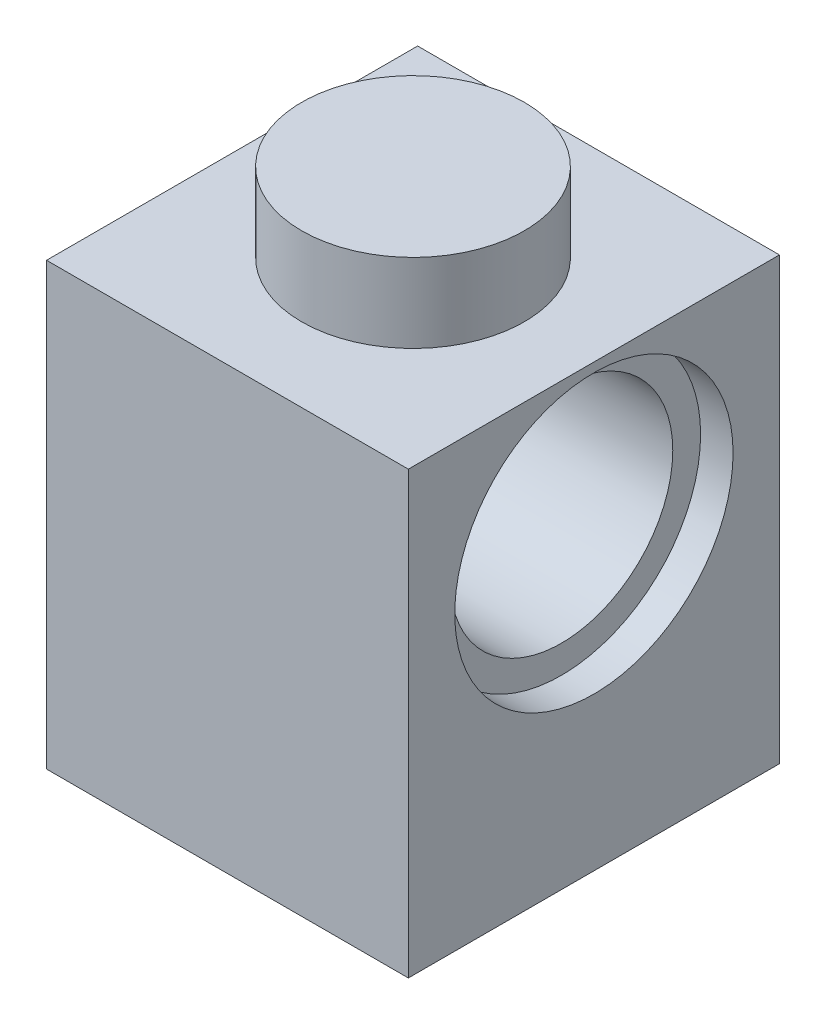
ISO-10303-21;
HEADER;
FILE_DESCRIPTION(('STEP AP214'),'2;1');
FILE_NAME('part.step','',(''),(''),'','','');
FILE_SCHEMA(('AUTOMOTIVE_DESIGN { 1 0 10303 214 1 1 1 1 }'));
ENDSEC;
DATA;
#1=APPLICATION_CONTEXT('core data for automotive mechanical design processes');
#2=APPLICATION_PROTOCOL_DEFINITION('international standard','automotive_design',2000,#1);
#3=PRODUCT_CONTEXT('',#1,'mechanical');
#4=PRODUCT('Part','Part','',(#3));
#5=PRODUCT_RELATED_PRODUCT_CATEGORY('part','',(#4));
#6=PRODUCT_DEFINITION_FORMATION('','',#4);
#7=PRODUCT_DEFINITION_CONTEXT('part definition',#1,'design');
#8=PRODUCT_DEFINITION('design','',#6,#7);
#9=PRODUCT_DEFINITION_SHAPE('','',#8);
#10=(LENGTH_UNIT() NAMED_UNIT(*) SI_UNIT(.MILLI.,.METRE.));
#11=(NAMED_UNIT(*) PLANE_ANGLE_UNIT() SI_UNIT($,.RADIAN.));
#12=(NAMED_UNIT(*) SI_UNIT($,.STERADIAN.) SOLID_ANGLE_UNIT());
#13=UNCERTAINTY_MEASURE_WITH_UNIT(LENGTH_MEASURE(1.E-05),#10,'distance_accuracy_value','');
#14=(GEOMETRIC_REPRESENTATION_CONTEXT(3) GLOBAL_UNCERTAINTY_ASSIGNED_CONTEXT((#13)) GLOBAL_UNIT_ASSIGNED_CONTEXT((#10,
#11,#12)) REPRESENTATION_CONTEXT('',''));
#15=CARTESIAN_POINT('',(0.,0.,0.));
#16=DIRECTION('',(0.,0.,1.));
#17=DIRECTION('',(1.,0.,0.));
#18=AXIS2_PLACEMENT_3D('',#15,#16,#17);
#19=CARTESIAN_POINT('',(-3.9,9.5,-4.));
#20=DIRECTION('',(0.,1.,0.));
#21=DIRECTION('',(0.,0.,1.));
#22=AXIS2_PLACEMENT_3D('',#19,#20,#21);
#23=PLANE('',#22);
#24=DIRECTION('',(0.,0.,1.));
#25=VECTOR('',#24,1.);
#26=CARTESIAN_POINT('',(-3.9,9.5,4.));
#27=LINE('',#26,#25);
#28=CARTESIAN_POINT('',(-3.9,9.5,-4.));
#29=VERTEX_POINT('',#28);
#30=CARTESIAN_POINT('',(-3.9,9.5,4.));
#31=VERTEX_POINT('',#30);
#32=EDGE_CURVE('E155',#29,#31,#27,.T.);
#33=ORIENTED_EDGE('',*,*,#32,.T.);
#34=DIRECTION('',(1.,0.,0.));
#35=VECTOR('',#34,1.);
#36=CARTESIAN_POINT('',(3.9,9.5,4.));
#37=LINE('',#36,#35);
#38=CARTESIAN_POINT('',(3.9,9.5,4.));
#39=VERTEX_POINT('',#38);
#40=EDGE_CURVE('E90',#31,#39,#37,.T.);
#41=ORIENTED_EDGE('',*,*,#40,.T.);
#42=DIRECTION('',(0.,0.,-1.));
#43=VECTOR('',#42,1.);
#44=CARTESIAN_POINT('',(3.9,9.5,4.));
#45=LINE('',#44,#43);
#46=CARTESIAN_POINT('',(3.9,9.5,-4.));
#47=VERTEX_POINT('',#46);
#48=EDGE_CURVE('E158',#39,#47,#45,.T.);
#49=ORIENTED_EDGE('',*,*,#48,.T.);
#50=DIRECTION('',(-1.,0.,0.));
#51=VECTOR('',#50,1.);
#52=CARTESIAN_POINT('',(3.9,9.5,-4.));
#53=LINE('',#52,#51);
#54=EDGE_CURVE('E62',#47,#29,#53,.T.);
#55=ORIENTED_EDGE('',*,*,#54,.T.);
#56=EDGE_LOOP('',(#33,#41,#49,#55));
#57=FACE_BOUND('',#56,.T.);
#58=CARTESIAN_POINT('',(0.,9.5,0.));
#59=DIRECTION('',(0.,1.,0.));
#60=DIRECTION('',(0.,0.,1.));
#61=AXIS2_PLACEMENT_3D('',#58,#59,#60);
#62=CIRCLE('',#61,2.4);
#63=CARTESIAN_POINT('',(0.,9.5,2.4));
#64=VERTEX_POINT('',#63);
#65=EDGE_CURVE('E138',#64,#64,#62,.T.);
#66=ORIENTED_EDGE('',*,*,#65,.F.);
#67=EDGE_LOOP('',(#66));
#68=FACE_BOUND('',#67,.T.);
#69=ADVANCED_FACE('F37',(#57,#68),#23,.T.);
#70=CARTESIAN_POINT('',(-3.9,9.5,4.));
#71=DIRECTION('',(1.,0.,0.));
#72=DIRECTION('',(0.,0.,-1.));
#73=AXIS2_PLACEMENT_3D('',#70,#71,#72);
#74=PLANE('',#73);
#75=CARTESIAN_POINT('',(-3.9,6.3,0.));
#76=DIRECTION('',(-1.,0.,0.));
#77=DIRECTION('',(0.,0.,1.));
#78=AXIS2_PLACEMENT_3D('',#75,#76,#77);
#79=CIRCLE('',#78,3.);
#80=CARTESIAN_POINT('',(-3.9,6.3,3.));
#81=VERTEX_POINT('',#80);
#82=EDGE_CURVE('E253',#81,#81,#79,.T.);
#83=ORIENTED_EDGE('',*,*,#82,.F.);
#84=EDGE_LOOP('',(#83));
#85=FACE_BOUND('',#84,.T.);
#86=DIRECTION('',(0.,0.,1.));
#87=VECTOR('',#86,1.);
#88=CARTESIAN_POINT('',(-3.9,0.,4.));
#89=LINE('',#88,#87);
#90=CARTESIAN_POINT('',(-3.9,0.,-4.));
#91=VERTEX_POINT('',#90);
#92=CARTESIAN_POINT('',(-3.9,0.,4.));
#93=VERTEX_POINT('',#92);
#94=EDGE_CURVE('E151',#91,#93,#89,.T.);
#95=ORIENTED_EDGE('',*,*,#94,.T.);
#96=DIRECTION('',(0.,-1.,0.));
#97=VECTOR('',#96,1.);
#98=CARTESIAN_POINT('',(-3.9,9.5,4.));
#99=LINE('',#98,#97);
#100=EDGE_CURVE('E11',#31,#93,#99,.T.);
#101=ORIENTED_EDGE('',*,*,#100,.F.);
#102=ORIENTED_EDGE('',*,*,#32,.F.);
#103=DIRECTION('',(0.,-1.,0.));
#104=VECTOR('',#103,1.);
#105=CARTESIAN_POINT('',(-3.9,9.5,-4.));
#106=LINE('',#105,#104);
#107=EDGE_CURVE('E161',#29,#91,#106,.T.);
#108=ORIENTED_EDGE('',*,*,#107,.T.);
#109=EDGE_LOOP('',(#95,#101,#102,#108));
#110=FACE_BOUND('',#109,.T.);
#111=ADVANCED_FACE('F39',(#85,#110),#74,.F.);
#112=CARTESIAN_POINT('',(3.9,9.5,4.));
#113=DIRECTION('',(0.,0.,-1.));
#114=DIRECTION('',(-1.,0.,0.));
#115=AXIS2_PLACEMENT_3D('',#112,#113,#114);
#116=PLANE('',#115);
#117=DIRECTION('',(1.,0.,0.));
#118=VECTOR('',#117,1.);
#119=CARTESIAN_POINT('',(3.9,0.,4.));
#120=LINE('',#119,#118);
#121=CARTESIAN_POINT('',(3.9,0.,4.));
#122=VERTEX_POINT('',#121);
#123=EDGE_CURVE('E164',#93,#122,#120,.T.);
#124=ORIENTED_EDGE('',*,*,#123,.T.);
#125=DIRECTION('',(0.,-1.,0.));
#126=VECTOR('',#125,1.);
#127=CARTESIAN_POINT('',(3.9,9.5,4.));
#128=LINE('',#127,#126);
#129=EDGE_CURVE('E46',#39,#122,#128,.T.);
#130=ORIENTED_EDGE('',*,*,#129,.F.);
#131=ORIENTED_EDGE('',*,*,#40,.F.);
#132=ORIENTED_EDGE('',*,*,#100,.T.);
#133=EDGE_LOOP('',(#124,#130,#131,#132));
#134=FACE_BOUND('',#133,.T.);
#135=ADVANCED_FACE('F193',(#134),#116,.F.);
#136=CARTESIAN_POINT('',(3.9,9.5,4.));
#137=DIRECTION('',(-1.,0.,0.));
#138=DIRECTION('',(0.,0.,1.));
#139=AXIS2_PLACEMENT_3D('',#136,#137,#138);
#140=PLANE('',#139);
#141=CARTESIAN_POINT('',(3.9,6.3,0.));
#142=DIRECTION('',(1.,0.,0.));
#143=DIRECTION('',(0.,0.,-1.));
#144=AXIS2_PLACEMENT_3D('',#141,#142,#143);
#145=CIRCLE('',#144,3.);
#146=CARTESIAN_POINT('',(3.9,6.3,-3.));
#147=VERTEX_POINT('',#146);
#148=EDGE_CURVE('E260',#147,#147,#145,.T.);
#149=ORIENTED_EDGE('',*,*,#148,.F.);
#150=EDGE_LOOP('',(#149));
#151=FACE_BOUND('',#150,.T.);
#152=DIRECTION('',(0.,0.,-1.));
#153=VECTOR('',#152,1.);
#154=CARTESIAN_POINT('',(3.9,0.,4.));
#155=LINE('',#154,#153);
#156=CARTESIAN_POINT('',(3.9,0.,-4.));
#157=VERTEX_POINT('',#156);
#158=EDGE_CURVE('E166',#122,#157,#155,.T.);
#159=ORIENTED_EDGE('',*,*,#158,.T.);
#160=DIRECTION('',(0.,-1.,0.));
#161=VECTOR('',#160,1.);
#162=CARTESIAN_POINT('',(3.9,9.5,-4.));
#163=LINE('',#162,#161);
#164=EDGE_CURVE('E170',#47,#157,#163,.T.);
#165=ORIENTED_EDGE('',*,*,#164,.F.);
#166=ORIENTED_EDGE('',*,*,#48,.F.);
#167=ORIENTED_EDGE('',*,*,#129,.T.);
#168=EDGE_LOOP('',(#159,#165,#166,#167));
#169=FACE_BOUND('',#168,.T.);
#170=ADVANCED_FACE('F176',(#151,#169),#140,.F.);
#171=CARTESIAN_POINT('',(3.9,9.5,-4.));
#172=DIRECTION('',(0.,0.,1.));
#173=DIRECTION('',(1.,0.,0.));
#174=AXIS2_PLACEMENT_3D('',#171,#172,#173);
#175=PLANE('',#174);
#176=DIRECTION('',(-1.,0.,0.));
#177=VECTOR('',#176,1.);
#178=CARTESIAN_POINT('',(3.9,0.,-4.));
#179=LINE('',#178,#177);
#180=EDGE_CURVE('E83',#157,#91,#179,.T.);
#181=ORIENTED_EDGE('',*,*,#180,.T.);
#182=ORIENTED_EDGE('',*,*,#107,.F.);
#183=ORIENTED_EDGE('',*,*,#54,.F.);
#184=ORIENTED_EDGE('',*,*,#164,.T.);
#185=EDGE_LOOP('',(#181,#182,#183,#184));
#186=FACE_BOUND('',#185,.T.);
#187=ADVANCED_FACE('F184',(#186),#175,.F.);
#188=CARTESIAN_POINT('',(-3.9,0.,-4.));
#189=DIRECTION('',(0.,1.,0.));
#190=DIRECTION('',(0.,0.,1.));
#191=AXIS2_PLACEMENT_3D('',#188,#189,#190);
#192=PLANE('',#191);
#193=DIRECTION('',(1.,0.,0.));
#194=VECTOR('',#193,1.);
#195=CARTESIAN_POINT('',(2.45,0.,-2.55));
#196=LINE('',#195,#194);
#197=CARTESIAN_POINT('',(-2.45,0.,-2.55));
#198=VERTEX_POINT('',#197);
#199=CARTESIAN_POINT('',(2.45,0.,-2.55));
#200=VERTEX_POINT('',#199);
#201=EDGE_CURVE('E144',#198,#200,#196,.T.);
#202=ORIENTED_EDGE('',*,*,#201,.F.);
#203=DIRECTION('',(0.,0.,-1.));
#204=VECTOR('',#203,1.);
#205=CARTESIAN_POINT('',(-2.45,0.,-2.55));
#206=LINE('',#205,#204);
#207=CARTESIAN_POINT('',(-2.45,0.,2.55));
#208=VERTEX_POINT('',#207);
#209=EDGE_CURVE('E53',#208,#198,#206,.T.);
#210=ORIENTED_EDGE('',*,*,#209,.F.);
#211=DIRECTION('',(-1.,0.,0.));
#212=VECTOR('',#211,1.);
#213=CARTESIAN_POINT('',(2.45,0.,2.55));
#214=LINE('',#213,#212);
#215=CARTESIAN_POINT('',(2.45,0.,2.55));
#216=VERTEX_POINT('',#215);
#217=EDGE_CURVE('E132',#216,#208,#214,.T.);
#218=ORIENTED_EDGE('',*,*,#217,.F.);
#219=DIRECTION('',(0.,0.,1.));
#220=VECTOR('',#219,1.);
#221=CARTESIAN_POINT('',(2.45,0.,-2.55));
#222=LINE('',#221,#220);
#223=EDGE_CURVE('E135',#200,#216,#222,.T.);
#224=ORIENTED_EDGE('',*,*,#223,.F.);
#225=EDGE_LOOP('',(#202,#210,#218,#224));
#226=FACE_BOUND('',#225,.T.);
#227=ORIENTED_EDGE('',*,*,#94,.F.);
#228=ORIENTED_EDGE('',*,*,#180,.F.);
#229=ORIENTED_EDGE('',*,*,#158,.F.);
#230=ORIENTED_EDGE('',*,*,#123,.F.);
#231=EDGE_LOOP('',(#227,#228,#229,#230));
#232=FACE_BOUND('',#231,.T.);
#233=ADVANCED_FACE('F180',(#226,#232),#192,.F.);
#234=CARTESIAN_POINT('',(-2.45,2.,-2.55));
#235=DIRECTION('',(-1.,0.,0.));
#236=DIRECTION('',(0.,0.,1.));
#237=AXIS2_PLACEMENT_3D('',#234,#235,#236);
#238=PLANE('',#237);
#239=ORIENTED_EDGE('',*,*,#209,.T.);
#240=DIRECTION('',(0.,-1.,0.));
#241=VECTOR('',#240,1.);
#242=CARTESIAN_POINT('',(-2.45,2.,-2.55));
#243=LINE('',#242,#241);
#244=CARTESIAN_POINT('',(-2.45,2.,-2.55));
#245=VERTEX_POINT('',#244);
#246=EDGE_CURVE('E110',#245,#198,#243,.T.);
#247=ORIENTED_EDGE('',*,*,#246,.F.);
#248=DIRECTION('',(0.,0.,-1.));
#249=VECTOR('',#248,1.);
#250=CARTESIAN_POINT('',(-2.45,2.,-2.55));
#251=LINE('',#250,#249);
#252=CARTESIAN_POINT('',(-2.45,2.,2.55));
#253=VERTEX_POINT('',#252);
#254=EDGE_CURVE('E114',#253,#245,#251,.T.);
#255=ORIENTED_EDGE('',*,*,#254,.F.);
#256=DIRECTION('',(0.,-1.,0.));
#257=VECTOR('',#256,1.);
#258=CARTESIAN_POINT('',(-2.45,2.,2.55));
#259=LINE('',#258,#257);
#260=EDGE_CURVE('E149',#253,#208,#259,.T.);
#261=ORIENTED_EDGE('',*,*,#260,.T.);
#262=EDGE_LOOP('',(#239,#247,#255,#261));
#263=FACE_BOUND('',#262,.T.);
#264=ADVANCED_FACE('F112',(#263),#238,.F.);
#265=CARTESIAN_POINT('',(2.45,2.,2.55));
#266=DIRECTION('',(0.,0.,1.));
#267=DIRECTION('',(1.,0.,0.));
#268=AXIS2_PLACEMENT_3D('',#265,#266,#267);
#269=PLANE('',#268);
#270=ORIENTED_EDGE('',*,*,#217,.T.);
#271=ORIENTED_EDGE('',*,*,#260,.F.);
#272=DIRECTION('',(-1.,0.,0.));
#273=VECTOR('',#272,1.);
#274=CARTESIAN_POINT('',(2.45,2.,2.55));
#275=LINE('',#274,#273);
#276=CARTESIAN_POINT('',(2.45,2.,2.55));
#277=VERTEX_POINT('',#276);
#278=EDGE_CURVE('E120',#277,#253,#275,.T.);
#279=ORIENTED_EDGE('',*,*,#278,.F.);
#280=DIRECTION('',(0.,-1.,0.));
#281=VECTOR('',#280,1.);
#282=CARTESIAN_POINT('',(2.45,2.,2.55));
#283=LINE('',#282,#281);
#284=EDGE_CURVE('E152',#277,#216,#283,.T.);
#285=ORIENTED_EDGE('',*,*,#284,.T.);
#286=EDGE_LOOP('',(#270,#271,#279,#285));
#287=FACE_BOUND('',#286,.T.);
#288=ADVANCED_FACE('F206',(#287),#269,.F.);
#289=CARTESIAN_POINT('',(2.45,2.,-2.55));
#290=DIRECTION('',(1.,0.,0.));
#291=DIRECTION('',(0.,0.,-1.));
#292=AXIS2_PLACEMENT_3D('',#289,#290,#291);
#293=PLANE('',#292);
#294=ORIENTED_EDGE('',*,*,#223,.T.);
#295=ORIENTED_EDGE('',*,*,#284,.F.);
#296=DIRECTION('',(0.,0.,1.));
#297=VECTOR('',#296,1.);
#298=CARTESIAN_POINT('',(2.45,2.,-2.55));
#299=LINE('',#298,#297);
#300=CARTESIAN_POINT('',(2.45,2.,-2.55));
#301=VERTEX_POINT('',#300);
#302=EDGE_CURVE('E128',#301,#277,#299,.T.);
#303=ORIENTED_EDGE('',*,*,#302,.F.);
#304=DIRECTION('',(0.,-1.,0.));
#305=VECTOR('',#304,1.);
#306=CARTESIAN_POINT('',(2.45,2.,-2.55));
#307=LINE('',#306,#305);
#308=EDGE_CURVE('E119',#301,#200,#307,.T.);
#309=ORIENTED_EDGE('',*,*,#308,.T.);
#310=EDGE_LOOP('',(#294,#295,#303,#309));
#311=FACE_BOUND('',#310,.T.);
#312=ADVANCED_FACE('F209',(#311),#293,.F.);
#313=CARTESIAN_POINT('',(2.45,2.,-2.55));
#314=DIRECTION('',(0.,0.,-1.));
#315=DIRECTION('',(-1.,0.,0.));
#316=AXIS2_PLACEMENT_3D('',#313,#314,#315);
#317=PLANE('',#316);
#318=ORIENTED_EDGE('',*,*,#201,.T.);
#319=ORIENTED_EDGE('',*,*,#308,.F.);
#320=DIRECTION('',(1.,0.,0.));
#321=VECTOR('',#320,1.);
#322=CARTESIAN_POINT('',(2.45,2.,-2.55));
#323=LINE('',#322,#321);
#324=EDGE_CURVE('E123',#245,#301,#323,.T.);
#325=ORIENTED_EDGE('',*,*,#324,.F.);
#326=ORIENTED_EDGE('',*,*,#246,.T.);
#327=EDGE_LOOP('',(#318,#319,#325,#326));
#328=FACE_BOUND('',#327,.T.);
#329=ADVANCED_FACE('F124',(#328),#317,.F.);
#330=CARTESIAN_POINT('',(-2.45,2.,2.55));
#331=DIRECTION('',(0.,-1.,0.));
#332=DIRECTION('',(0.,0.,-1.));
#333=AXIS2_PLACEMENT_3D('',#330,#331,#332);
#334=PLANE('',#333);
#335=ORIENTED_EDGE('',*,*,#254,.T.);
#336=ORIENTED_EDGE('',*,*,#324,.T.);
#337=ORIENTED_EDGE('',*,*,#302,.T.);
#338=ORIENTED_EDGE('',*,*,#278,.T.);
#339=EDGE_LOOP('',(#335,#336,#337,#338));
#340=FACE_BOUND('',#339,.T.);
#341=ADVANCED_FACE('F130',(#340),#334,.T.);
#342=CARTESIAN_POINT('',(0.,11.2,0.));
#343=DIRECTION('',(0.,-1.,0.));
#344=DIRECTION('',(0.,0.,-1.));
#345=AXIS2_PLACEMENT_3D('',#342,#343,#344);
#346=CYLINDRICAL_SURFACE('',#345,2.4);
#347=CARTESIAN_POINT('',(0.,11.2,0.));
#348=DIRECTION('',(0.,1.,0.));
#349=DIRECTION('',(0.,0.,1.));
#350=AXIS2_PLACEMENT_3D('',#347,#348,#349);
#351=CIRCLE('',#350,2.4);
#352=CARTESIAN_POINT('',(0.,11.2,2.4));
#353=VERTEX_POINT('',#352);
#354=EDGE_CURVE('E145',#353,#353,#351,.T.);
#355=ORIENTED_EDGE('',*,*,#354,.F.);
#356=EDGE_LOOP('',(#355));
#357=FACE_BOUND('',#356,.T.);
#358=ORIENTED_EDGE('',*,*,#65,.T.);
#359=EDGE_LOOP('',(#358));
#360=FACE_BOUND('',#359,.T.);
#361=ADVANCED_FACE('F218',(#357,#360),#346,.T.);
#362=CARTESIAN_POINT('',(0.,11.2,0.));
#363=DIRECTION('',(0.,1.,0.));
#364=DIRECTION('',(0.,0.,1.));
#365=AXIS2_PLACEMENT_3D('',#362,#363,#364);
#366=PLANE('',#365);
#367=ORIENTED_EDGE('',*,*,#354,.T.);
#368=EDGE_LOOP('',(#367));
#369=FACE_BOUND('',#368,.T.);
#370=ADVANCED_FACE('F221',(#369),#366,.T.);
#371=CARTESIAN_POINT('',(3.2,6.3,0.));
#372=DIRECTION('',(1.,0.,0.));
#373=DIRECTION('',(0.,0.,-1.));
#374=AXIS2_PLACEMENT_3D('',#371,#372,#373);
#375=CYLINDRICAL_SURFACE('',#374,3.);
#376=CARTESIAN_POINT('',(3.2,6.3,0.));
#377=DIRECTION('',(1.,0.,0.));
#378=DIRECTION('',(0.,0.,-1.));
#379=AXIS2_PLACEMENT_3D('',#376,#377,#378);
#380=CIRCLE('',#379,3.);
#381=CARTESIAN_POINT('',(3.2,6.3,-3.));
#382=VERTEX_POINT('',#381);
#383=EDGE_CURVE('E262',#382,#382,#380,.T.);
#384=ORIENTED_EDGE('',*,*,#383,.F.);
#385=EDGE_LOOP('',(#384));
#386=FACE_BOUND('',#385,.T.);
#387=ORIENTED_EDGE('',*,*,#148,.T.);
#388=EDGE_LOOP('',(#387));
#389=FACE_BOUND('',#388,.T.);
#390=ADVANCED_FACE('F225',(#386,#389),#375,.F.);
#391=CARTESIAN_POINT('',(3.2,6.3,0.));
#392=DIRECTION('',(1.,0.,0.));
#393=DIRECTION('',(0.,0.,-1.));
#394=AXIS2_PLACEMENT_3D('',#391,#392,#393);
#395=PLANE('',#394);
#396=CARTESIAN_POINT('',(3.2,6.3,0.));
#397=DIRECTION('',(1.,0.,0.));
#398=DIRECTION('',(0.,0.,-1.));
#399=AXIS2_PLACEMENT_3D('',#396,#397,#398);
#400=CIRCLE('',#399,2.4);
#401=CARTESIAN_POINT('',(3.2,6.3,-2.4));
#402=VERTEX_POINT('',#401);
#403=EDGE_CURVE('E250',#402,#402,#400,.T.);
#404=ORIENTED_EDGE('',*,*,#403,.F.);
#405=EDGE_LOOP('',(#404));
#406=FACE_BOUND('',#405,.T.);
#407=ORIENTED_EDGE('',*,*,#383,.T.);
#408=EDGE_LOOP('',(#407));
#409=FACE_BOUND('',#408,.T.);
#410=ADVANCED_FACE('F229',(#406,#409),#395,.T.);
#411=CARTESIAN_POINT('',(-3.2,6.3,0.));
#412=DIRECTION('',(-1.,0.,0.));
#413=DIRECTION('',(0.,0.,1.));
#414=AXIS2_PLACEMENT_3D('',#411,#412,#413);
#415=CYLINDRICAL_SURFACE('',#414,3.);
#416=CARTESIAN_POINT('',(-3.2,6.3,0.));
#417=DIRECTION('',(-1.,0.,0.));
#418=DIRECTION('',(0.,0.,1.));
#419=AXIS2_PLACEMENT_3D('',#416,#417,#418);
#420=CIRCLE('',#419,3.);
#421=CARTESIAN_POINT('',(-3.2,6.3,3.));
#422=VERTEX_POINT('',#421);
#423=EDGE_CURVE('E256',#422,#422,#420,.T.);
#424=ORIENTED_EDGE('',*,*,#423,.F.);
#425=EDGE_LOOP('',(#424));
#426=FACE_BOUND('',#425,.T.);
#427=ORIENTED_EDGE('',*,*,#82,.T.);
#428=EDGE_LOOP('',(#427));
#429=FACE_BOUND('',#428,.T.);
#430=ADVANCED_FACE('F233',(#426,#429),#415,.F.);
#431=CARTESIAN_POINT('',(-3.2,6.3,0.));
#432=DIRECTION('',(-1.,0.,0.));
#433=DIRECTION('',(0.,0.,1.));
#434=AXIS2_PLACEMENT_3D('',#431,#432,#433);
#435=PLANE('',#434);
#436=CARTESIAN_POINT('',(-3.2,6.3,0.));
#437=DIRECTION('',(-1.,0.,0.));
#438=DIRECTION('',(0.,0.,1.));
#439=AXIS2_PLACEMENT_3D('',#436,#437,#438);
#440=CIRCLE('',#439,2.4);
#441=CARTESIAN_POINT('',(-3.2,6.3,2.4));
#442=VERTEX_POINT('',#441);
#443=EDGE_CURVE('E41',#442,#442,#440,.T.);
#444=ORIENTED_EDGE('',*,*,#443,.F.);
#445=EDGE_LOOP('',(#444));
#446=FACE_BOUND('',#445,.T.);
#447=ORIENTED_EDGE('',*,*,#423,.T.);
#448=EDGE_LOOP('',(#447));
#449=FACE_BOUND('',#448,.T.);
#450=ADVANCED_FACE('F237',(#446,#449),#435,.T.);
#451=CARTESIAN_POINT('',(3.9,6.3,0.));
#452=DIRECTION('',(-1.,0.,0.));
#453=DIRECTION('',(0.,0.,1.));
#454=AXIS2_PLACEMENT_3D('',#451,#452,#453);
#455=CYLINDRICAL_SURFACE('',#454,2.4);
#456=ORIENTED_EDGE('',*,*,#403,.T.);
#457=EDGE_LOOP('',(#456));
#458=FACE_BOUND('',#457,.T.);
#459=ORIENTED_EDGE('',*,*,#443,.T.);
#460=EDGE_LOOP('',(#459));
#461=FACE_BOUND('',#460,.T.);
#462=ADVANCED_FACE('F241',(#458,#461),#455,.F.);
#463=CLOSED_SHELL('',(#69,#111,#135,#170,#187,#233,#264,#288,#312,#329,#341,#361,#370,#390,#410,
#430,#450,#462));
#464=MANIFOLD_SOLID_BREP('B2',#463);
#465=ADVANCED_BREP_SHAPE_REPRESENTATION('',(#18,#464),#14);
#466=SHAPE_DEFINITION_REPRESENTATION(#9,#465);
ENDSEC;
END-ISO-10303-21;
